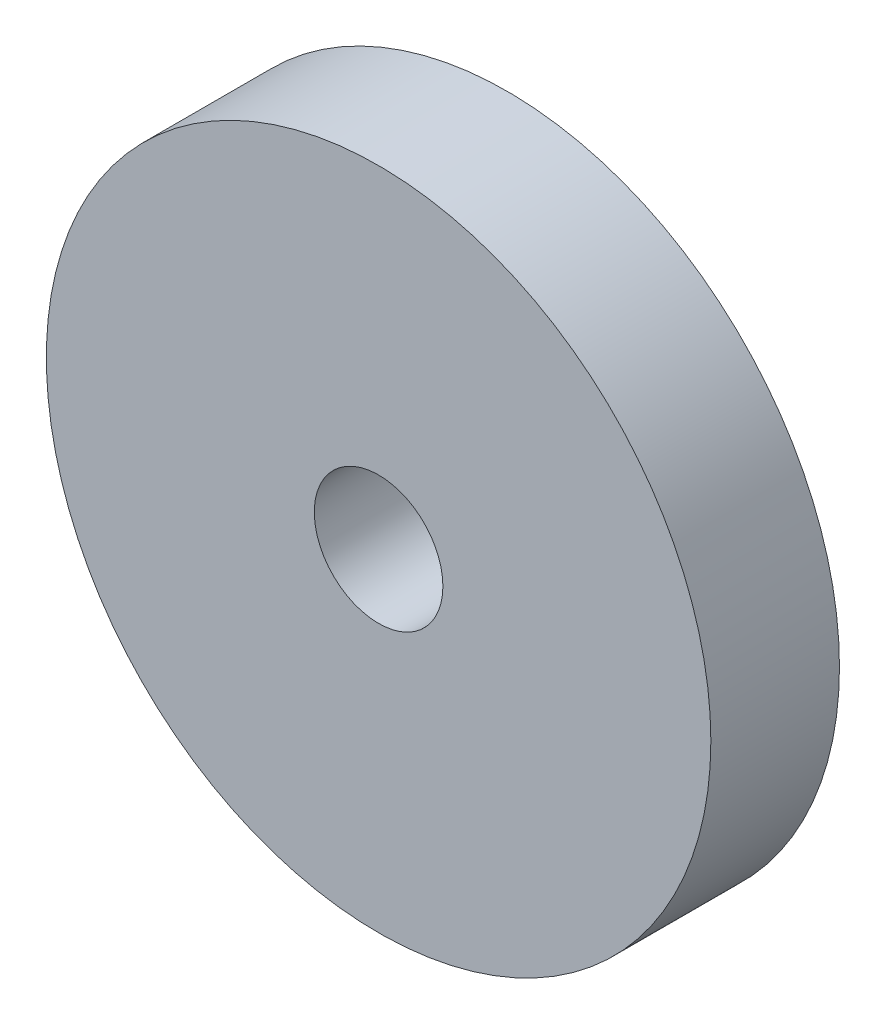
ISO-10303-21;
HEADER;
FILE_DESCRIPTION(('STEP AP214'),'2;1');
FILE_NAME('part.step','',(''),(''),'','','');
FILE_SCHEMA(('AUTOMOTIVE_DESIGN { 1 0 10303 214 1 1 1 1 }'));
ENDSEC;
DATA;
#1=APPLICATION_CONTEXT('core data for automotive mechanical design processes');
#2=APPLICATION_PROTOCOL_DEFINITION('international standard','automotive_design',2000,#1);
#3=PRODUCT_CONTEXT('',#1,'mechanical');
#4=PRODUCT('Part','Part','',(#3));
#5=PRODUCT_RELATED_PRODUCT_CATEGORY('part','',(#4));
#6=PRODUCT_DEFINITION_FORMATION('','',#4);
#7=PRODUCT_DEFINITION_CONTEXT('part definition',#1,'design');
#8=PRODUCT_DEFINITION('design','',#6,#7);
#9=PRODUCT_DEFINITION_SHAPE('','',#8);
#10=(LENGTH_UNIT() NAMED_UNIT(*) SI_UNIT(.MILLI.,.METRE.));
#11=(NAMED_UNIT(*) PLANE_ANGLE_UNIT() SI_UNIT($,.RADIAN.));
#12=(NAMED_UNIT(*) SI_UNIT($,.STERADIAN.) SOLID_ANGLE_UNIT());
#13=UNCERTAINTY_MEASURE_WITH_UNIT(LENGTH_MEASURE(1.E-05),#10,'distance_accuracy_value','');
#14=(GEOMETRIC_REPRESENTATION_CONTEXT(3) GLOBAL_UNCERTAINTY_ASSIGNED_CONTEXT((#13)) GLOBAL_UNIT_ASSIGNED_CONTEXT((#10,
#11,#12)) REPRESENTATION_CONTEXT('',''));
#15=CARTESIAN_POINT('',(0.,0.,0.));
#16=DIRECTION('',(0.,0.,1.));
#17=DIRECTION('',(1.,0.,0.));
#18=AXIS2_PLACEMENT_3D('',#15,#16,#17);
#19=CARTESIAN_POINT('',(0.,0.,6.));
#20=DIRECTION('',(0.,0.,1.));
#21=DIRECTION('',(1.,0.,0.));
#22=AXIS2_PLACEMENT_3D('',#19,#20,#21);
#23=PLANE('',#22);
#24=CARTESIAN_POINT('',(0.,0.,6.));
#25=DIRECTION('',(0.,0.,1.));
#26=DIRECTION('',(1.,0.,0.));
#27=AXIS2_PLACEMENT_3D('',#24,#25,#26);
#28=CIRCLE('',#27,15.5);
#29=CARTESIAN_POINT('',(15.5,0.,6.));
#30=VERTEX_POINT('',#29);
#31=EDGE_CURVE('E10',#30,#30,#28,.T.);
#32=ORIENTED_EDGE('',*,*,#31,.T.);
#33=EDGE_LOOP('',(#32));
#34=FACE_BOUND('',#33,.T.);
#35=CARTESIAN_POINT('',(0.,0.,6.));
#36=DIRECTION('',(0.,0.,1.));
#37=DIRECTION('',(1.,0.,0.));
#38=AXIS2_PLACEMENT_3D('',#35,#36,#37);
#39=CIRCLE('',#38,3.);
#40=CARTESIAN_POINT('',(3.,0.,6.));
#41=VERTEX_POINT('',#40);
#42=EDGE_CURVE('E42',#41,#41,#39,.T.);
#43=ORIENTED_EDGE('',*,*,#42,.F.);
#44=EDGE_LOOP('',(#43));
#45=FACE_BOUND('',#44,.T.);
#46=ADVANCED_FACE('F31',(#34,#45),#23,.T.);
#47=CARTESIAN_POINT('',(0.,0.,0.));
#48=DIRECTION('',(0.,0.,1.));
#49=DIRECTION('',(1.,0.,0.));
#50=AXIS2_PLACEMENT_3D('',#47,#48,#49);
#51=PLANE('',#50);
#52=CARTESIAN_POINT('',(0.,0.,0.));
#53=DIRECTION('',(0.,0.,1.));
#54=DIRECTION('',(1.,0.,0.));
#55=AXIS2_PLACEMENT_3D('',#52,#53,#54);
#56=CIRCLE('',#55,15.5);
#57=CARTESIAN_POINT('',(15.5,0.,0.));
#58=VERTEX_POINT('',#57);
#59=EDGE_CURVE('E35',#58,#58,#56,.T.);
#60=ORIENTED_EDGE('',*,*,#59,.F.);
#61=EDGE_LOOP('',(#60));
#62=FACE_BOUND('',#61,.T.);
#63=CARTESIAN_POINT('',(0.,0.,0.));
#64=DIRECTION('',(0.,0.,1.));
#65=DIRECTION('',(1.,0.,0.));
#66=AXIS2_PLACEMENT_3D('',#63,#64,#65);
#67=CIRCLE('',#66,3.);
#68=CARTESIAN_POINT('',(3.,0.,0.));
#69=VERTEX_POINT('',#68);
#70=EDGE_CURVE('E44',#69,#69,#67,.T.);
#71=ORIENTED_EDGE('',*,*,#70,.T.);
#72=EDGE_LOOP('',(#71));
#73=FACE_BOUND('',#72,.T.);
#74=ADVANCED_FACE('F54',(#62,#73),#51,.F.);
#75=CARTESIAN_POINT('',(0.,0.,6.));
#76=DIRECTION('',(0.,0.,-1.));
#77=DIRECTION('',(-1.,0.,0.));
#78=AXIS2_PLACEMENT_3D('',#75,#76,#77);
#79=CYLINDRICAL_SURFACE('',#78,15.5);
#80=ORIENTED_EDGE('',*,*,#31,.F.);
#81=EDGE_LOOP('',(#80));
#82=FACE_BOUND('',#81,.T.);
#83=ORIENTED_EDGE('',*,*,#59,.T.);
#84=EDGE_LOOP('',(#83));
#85=FACE_BOUND('',#84,.T.);
#86=ADVANCED_FACE('F33',(#82,#85),#79,.T.);
#87=CARTESIAN_POINT('',(0.,0.,6.));
#88=DIRECTION('',(0.,0.,-1.));
#89=DIRECTION('',(-1.,0.,0.));
#90=AXIS2_PLACEMENT_3D('',#87,#88,#89);
#91=CYLINDRICAL_SURFACE('',#90,3.);
#92=ORIENTED_EDGE('',*,*,#42,.T.);
#93=EDGE_LOOP('',(#92));
#94=FACE_BOUND('',#93,.T.);
#95=ORIENTED_EDGE('',*,*,#70,.F.);
#96=EDGE_LOOP('',(#95));
#97=FACE_BOUND('',#96,.T.);
#98=ADVANCED_FACE('F50',(#94,#97),#91,.F.);
#99=CLOSED_SHELL('',(#46,#74,#86,#98));
#100=MANIFOLD_SOLID_BREP('B2',#99);
#101=ADVANCED_BREP_SHAPE_REPRESENTATION('',(#18,#100),#14);
#102=SHAPE_DEFINITION_REPRESENTATION(#9,#101);
ENDSEC;
END-ISO-10303-21;
